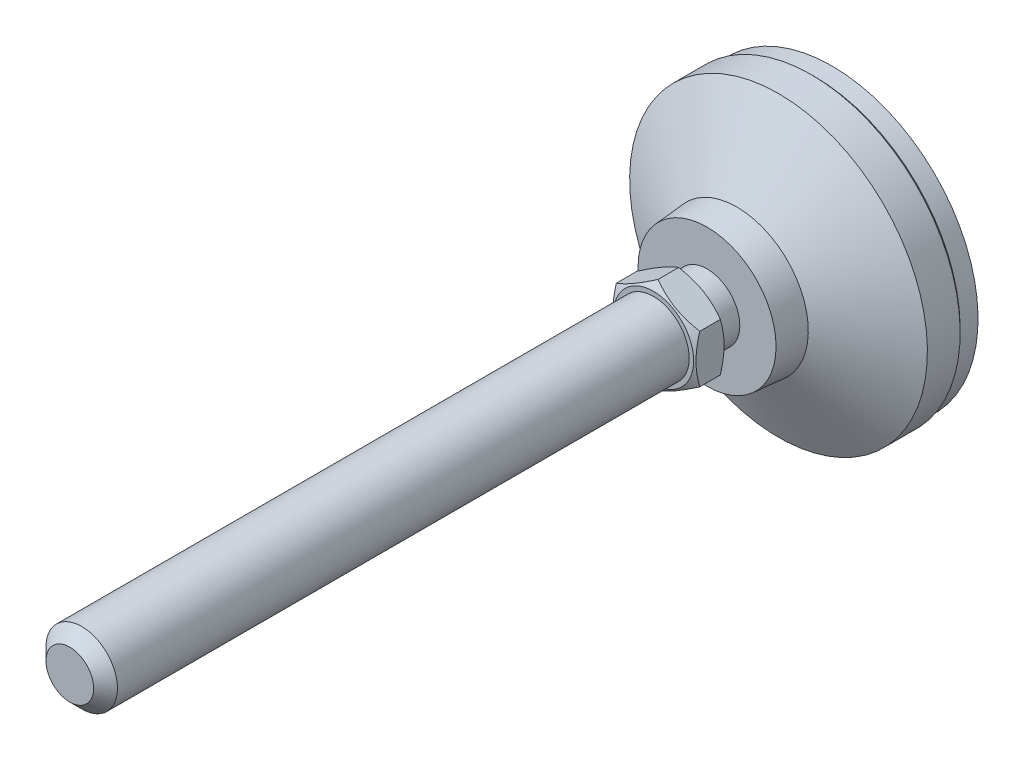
ISO-10303-21;
HEADER;
FILE_DESCRIPTION(('STEP AP214'),'2;1');
FILE_NAME('part.step','',(''),(''),'','','');
FILE_SCHEMA(('AUTOMOTIVE_DESIGN { 1 0 10303 214 1 1 1 1 }'));
ENDSEC;
DATA;
#1=APPLICATION_CONTEXT('core data for automotive mechanical design processes');
#2=APPLICATION_PROTOCOL_DEFINITION('international standard','automotive_design',2000,#1);
#3=PRODUCT_CONTEXT('',#1,'mechanical');
#4=PRODUCT('Part','Part','',(#3));
#5=PRODUCT_RELATED_PRODUCT_CATEGORY('part','',(#4));
#6=PRODUCT_DEFINITION_FORMATION('','',#4);
#7=PRODUCT_DEFINITION_CONTEXT('part definition',#1,'design');
#8=PRODUCT_DEFINITION('design','',#6,#7);
#9=PRODUCT_DEFINITION_SHAPE('','',#8);
#10=(LENGTH_UNIT() NAMED_UNIT(*) SI_UNIT(.MILLI.,.METRE.));
#11=(NAMED_UNIT(*) PLANE_ANGLE_UNIT() SI_UNIT($,.RADIAN.));
#12=(NAMED_UNIT(*) SI_UNIT($,.STERADIAN.) SOLID_ANGLE_UNIT());
#13=UNCERTAINTY_MEASURE_WITH_UNIT(LENGTH_MEASURE(1.E-05),#10,'distance_accuracy_value','');
#14=(GEOMETRIC_REPRESENTATION_CONTEXT(3) GLOBAL_UNCERTAINTY_ASSIGNED_CONTEXT((#13)) GLOBAL_UNIT_ASSIGNED_CONTEXT((#10,
#11,#12)) REPRESENTATION_CONTEXT('',''));
#15=CARTESIAN_POINT('',(0.,0.,0.));
#16=DIRECTION('',(0.,0.,1.));
#17=DIRECTION('',(1.,0.,0.));
#18=AXIS2_PLACEMENT_3D('',#15,#16,#17);
#19=CARTESIAN_POINT('',(0.,0.,1.99999999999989));
#20=DIRECTION('',(0.,0.,-1.));
#21=DIRECTION('',(0.,1.,0.));
#22=AXIS2_PLACEMENT_3D('',#19,#20,#21);
#23=CYLINDRICAL_SURFACE('',#22,5.5);
#24=CARTESIAN_POINT('',(0.,0.,24.9999999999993));
#25=DIRECTION('',(0.,0.,-1.));
#26=DIRECTION('',(0.,1.,0.));
#27=AXIS2_PLACEMENT_3D('',#24,#25,#26);
#28=CIRCLE('',#27,5.5);
#29=CARTESIAN_POINT('',(0.,5.5,24.9999999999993));
#30=VERTEX_POINT('',#29);
#31=EDGE_CURVE('E100',#30,#30,#28,.T.);
#32=ORIENTED_EDGE('',*,*,#31,.T.);
#33=EDGE_LOOP('',(#32));
#34=FACE_BOUND('',#33,.T.);
#35=CARTESIAN_POINT('',(0.,0.,21.));
#36=DIRECTION('',(0.,0.,-1.));
#37=DIRECTION('',(0.,1.,0.));
#38=AXIS2_PLACEMENT_3D('',#35,#36,#37);
#39=CIRCLE('',#38,5.5);
#40=CARTESIAN_POINT('',(0.,5.5,21.));
#41=VERTEX_POINT('',#40);
#42=EDGE_CURVE('E93',#41,#41,#39,.T.);
#43=ORIENTED_EDGE('',*,*,#42,.F.);
#44=EDGE_LOOP('',(#43));
#45=FACE_BOUND('',#44,.T.);
#46=ADVANCED_FACE('F14',(#34,#45),#23,.T.);
#47=CARTESIAN_POINT('',(-5.5,0.,24.9999999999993));
#48=DIRECTION('',(0.,0.,1.));
#49=DIRECTION('',(0.,-1.,0.));
#50=AXIS2_PLACEMENT_3D('',#47,#48,#49);
#51=PLANE('',#50);
#52=CARTESIAN_POINT('',(0.,0.,24.9999999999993));
#53=DIRECTION('',(0.,0.,1.));
#54=DIRECTION('',(0.,-1.,0.));
#55=AXIS2_PLACEMENT_3D('',#52,#53,#54);
#56=CIRCLE('',#55,6.75);
#57=CARTESIAN_POINT('',(0.,-6.75,24.9999999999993));
#58=VERTEX_POINT('',#57);
#59=EDGE_CURVE('E443',#58,#58,#56,.T.);
#60=ORIENTED_EDGE('',*,*,#59,.F.);
#61=EDGE_LOOP('',(#60));
#62=FACE_BOUND('',#61,.T.);
#63=ORIENTED_EDGE('',*,*,#31,.F.);
#64=EDGE_LOOP('',(#63));
#65=FACE_BOUND('',#64,.T.);
#66=ADVANCED_FACE('F137',(#62,#65),#51,.F.);
#67=CARTESIAN_POINT('',(0.,-5.5,21.));
#68=DIRECTION('',(0.,0.,1.));
#69=DIRECTION('',(0.,-1.,0.));
#70=AXIS2_PLACEMENT_3D('',#67,#68,#69);
#71=PLANE('',#70);
#72=ORIENTED_EDGE('',*,*,#42,.T.);
#73=EDGE_LOOP('',(#72));
#74=FACE_BOUND('',#73,.T.);
#75=CARTESIAN_POINT('',(0.,0.,21.));
#76=DIRECTION('',(0.,0.,1.));
#77=DIRECTION('',(0.,-1.,0.));
#78=AXIS2_PLACEMENT_3D('',#75,#76,#77);
#79=CIRCLE('',#78,11.5833333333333);
#80=CARTESIAN_POINT('',(0.,-11.5833333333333,21.));
#81=VERTEX_POINT('',#80);
#82=EDGE_CURVE('E88',#81,#81,#79,.T.);
#83=ORIENTED_EDGE('',*,*,#82,.T.);
#84=EDGE_LOOP('',(#83));
#85=FACE_BOUND('',#84,.T.);
#86=ADVANCED_FACE('F144',(#74,#85),#71,.T.);
#87=CARTESIAN_POINT('',(0.,0.,1.99999999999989));
#88=DIRECTION('',(0.,0.,-1.));
#89=DIRECTION('',(0.,1.,0.));
#90=AXIS2_PLACEMENT_3D('',#87,#88,#89);
#91=CYLINDRICAL_SURFACE('',#90,25.);
#92=CARTESIAN_POINT('',(0.,0.,3.5));
#93=DIRECTION('',(0.,0.,-1.));
#94=DIRECTION('',(0.,1.,0.));
#95=AXIS2_PLACEMENT_3D('',#92,#93,#94);
#96=CIRCLE('',#95,25.);
#97=CARTESIAN_POINT('',(0.,25.,3.5));
#98=VERTEX_POINT('',#97);
#99=EDGE_CURVE('E28',#98,#98,#96,.F.);
#100=ORIENTED_EDGE('',*,*,#99,.T.);
#101=EDGE_LOOP('',(#100));
#102=FACE_BOUND('',#101,.T.);
#103=CARTESIAN_POINT('',(0.,0.,9.));
#104=DIRECTION('',(0.,0.,-1.));
#105=DIRECTION('',(0.,1.,0.));
#106=AXIS2_PLACEMENT_3D('',#103,#104,#105);
#107=CIRCLE('',#106,25.);
#108=CARTESIAN_POINT('',(0.,25.,9.));
#109=VERTEX_POINT('',#108);
#110=EDGE_CURVE('E106',#109,#109,#107,.T.);
#111=ORIENTED_EDGE('',*,*,#110,.T.);
#112=EDGE_LOOP('',(#111));
#113=FACE_BOUND('',#112,.T.);
#114=ADVANCED_FACE('F114',(#102,#113),#91,.T.);
#115=CARTESIAN_POINT('',(0.,0.,16.));
#116=DIRECTION('',(0.,0.,-1.));
#117=DIRECTION('',(0.,1.,0.));
#118=AXIS2_PLACEMENT_3D('',#115,#116,#117);
#119=CONICAL_SURFACE('',#118,11.9999999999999,1.07685495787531);
#120=ORIENTED_EDGE('',*,*,#110,.F.);
#121=EDGE_LOOP('',(#120));
#122=FACE_BOUND('',#121,.T.);
#123=CARTESIAN_POINT('',(0.,0.,16.));
#124=DIRECTION('',(0.,0.,-1.));
#125=DIRECTION('',(0.,1.,0.));
#126=AXIS2_PLACEMENT_3D('',#123,#124,#125);
#127=CIRCLE('',#126,11.9999999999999);
#128=CARTESIAN_POINT('',(0.,11.9999999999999,16.));
#129=VERTEX_POINT('',#128);
#130=EDGE_CURVE('E103',#129,#129,#127,.T.);
#131=ORIENTED_EDGE('',*,*,#130,.T.);
#132=EDGE_LOOP('',(#131));
#133=FACE_BOUND('',#132,.T.);
#134=ADVANCED_FACE('F152',(#122,#133),#119,.T.);
#135=CARTESIAN_POINT('',(0.,0.,22.));
#136=DIRECTION('',(0.,0.,-1.));
#137=DIRECTION('',(0.,1.,0.));
#138=AXIS2_PLACEMENT_3D('',#135,#136,#137);
#139=CONICAL_SURFACE('',#138,11.5,0.0831412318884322);
#140=ORIENTED_EDGE('',*,*,#130,.F.);
#141=EDGE_LOOP('',(#140));
#142=FACE_BOUND('',#141,.T.);
#143=ORIENTED_EDGE('',*,*,#82,.F.);
#144=EDGE_LOOP('',(#143));
#145=FACE_BOUND('',#144,.T.);
#146=ADVANCED_FACE('F120',(#142,#145),#139,.T.);
#147=CARTESIAN_POINT('',(0.,0.,3.));
#148=DIRECTION('',(0.,0.,1.));
#149=DIRECTION('',(0.,-1.,0.));
#150=AXIS2_PLACEMENT_3D('',#147,#148,#149);
#151=CONICAL_SURFACE('',#150,24.5,0.785398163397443);
#152=ORIENTED_EDGE('',*,*,#99,.F.);
#153=EDGE_LOOP('',(#152));
#154=FACE_BOUND('',#153,.T.);
#155=CARTESIAN_POINT('',(0.,0.,3.));
#156=DIRECTION('',(0.,0.,-1.));
#157=DIRECTION('',(0.,1.,0.));
#158=AXIS2_PLACEMENT_3D('',#155,#156,#157);
#159=CIRCLE('',#158,24.5);
#160=CARTESIAN_POINT('',(0.,24.5,3.));
#161=VERTEX_POINT('',#160);
#162=EDGE_CURVE('E108',#161,#161,#159,.T.);
#163=ORIENTED_EDGE('',*,*,#162,.F.);
#164=EDGE_LOOP('',(#163));
#165=FACE_BOUND('',#164,.T.);
#166=ADVANCED_FACE('F16',(#154,#165),#151,.T.);
#167=CARTESIAN_POINT('',(0.,0.,0.));
#168=DIRECTION('',(0.,0.,1.));
#169=DIRECTION('',(0.,-1.,0.));
#170=AXIS2_PLACEMENT_3D('',#167,#168,#169);
#171=CYLINDRICAL_SURFACE('',#170,24.5);
#172=CARTESIAN_POINT('',(0.,0.,0.));
#173=DIRECTION('',(0.,0.,-1.));
#174=DIRECTION('',(0.,1.,0.));
#175=AXIS2_PLACEMENT_3D('',#172,#173,#174);
#176=CIRCLE('',#175,24.5);
#177=CARTESIAN_POINT('',(0.,24.5,0.));
#178=VERTEX_POINT('',#177);
#179=EDGE_CURVE('E260',#178,#178,#176,.T.);
#180=ORIENTED_EDGE('',*,*,#179,.F.);
#181=EDGE_LOOP('',(#180));
#182=FACE_BOUND('',#181,.T.);
#183=ORIENTED_EDGE('',*,*,#162,.T.);
#184=EDGE_LOOP('',(#183));
#185=FACE_BOUND('',#184,.T.);
#186=ADVANCED_FACE('F119',(#182,#185),#171,.T.);
#187=CARTESIAN_POINT('',(0.,0.,0.));
#188=DIRECTION('',(0.,0.,-1.));
#189=DIRECTION('',(0.,1.,0.));
#190=AXIS2_PLACEMENT_3D('',#187,#188,#189);
#191=PLANE('',#190);
#192=ORIENTED_EDGE('',*,*,#179,.T.);
#193=EDGE_LOOP('',(#192));
#194=FACE_BOUND('',#193,.T.);
#195=ADVANCED_FACE('F124',(#194),#191,.T.);
#196=CARTESIAN_POINT('',(0.,0.,24.9999999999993));
#197=DIRECTION('',(0.,0.,1.));
#198=DIRECTION('',(0.,-1.,0.));
#199=AXIS2_PLACEMENT_3D('',#196,#197,#198);
#200=CONICAL_SURFACE('',#199,6.75,1.0471975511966);
#201=CARTESIAN_POINT('',(0.000200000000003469,-8.0830192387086,25.7696190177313));
#202=CARTESIAN_POINT('',(-0.15366790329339,-7.99418356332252,25.7183374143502));
#203=CARTESIAN_POINT('',(-0.308109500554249,-7.90501666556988,25.6693831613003));
#204=CARTESIAN_POINT('',(-0.618246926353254,-7.72595873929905,25.5767703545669));
#205=CARTESIAN_POINT('',(-0.773943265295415,-7.63606741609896,25.5331140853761));
#206=CARTESIAN_POINT('',(-1.24352516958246,-7.36495417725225,25.4109491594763));
#207=CARTESIAN_POINT('',(-1.5592643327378,-7.18266208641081,25.3414631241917));
#208=CARTESIAN_POINT('',(-2.03176224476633,-6.90986528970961,25.2599825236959));
#209=CARTESIAN_POINT('',(-2.18710922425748,-6.82017566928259,25.2367710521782));
#210=CARTESIAN_POINT('',(-2.49850511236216,-6.64039116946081,25.1978487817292));
#211=CARTESIAN_POINT('',(-2.65455395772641,-6.55029632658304,25.1821373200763));
#212=CARTESIAN_POINT('',(-2.96692267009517,-6.36995016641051,25.1586154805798));
#213=CARTESIAN_POINT('',(-3.12324202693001,-6.27969914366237,25.1507961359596));
#214=CARTESIAN_POINT('',(-3.43601650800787,-6.09911871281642,25.1432178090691));
#215=CARTESIAN_POINT('',(-3.59247162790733,-6.00878930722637,25.1434585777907));
#216=CARTESIAN_POINT('',(-4.02110687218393,-5.76131663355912,25.1551972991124));
#217=CARTESIAN_POINT('',(-4.2931466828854,-5.60425437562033,25.1749033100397));
#218=CARTESIAN_POINT('',(-4.83541944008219,-5.29117305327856,25.2373910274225));
#219=CARTESIAN_POINT('',(-5.10565047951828,-5.13515508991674,25.2801940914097));
#220=CARTESIAN_POINT('',(-5.64901454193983,-4.82144370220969,25.3871892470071));
#221=CARTESIAN_POINT('',(-5.92207900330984,-4.6637898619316,25.4518346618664));
#222=CARTESIAN_POINT('',(-6.46413578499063,-4.35083323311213,25.5985536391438));
#223=CARTESIAN_POINT('',(-6.73313504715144,-4.19552643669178,25.6805927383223));
#224=CARTESIAN_POINT('',(-7.0002,-4.04133641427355,25.7696190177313));
#225=B_SPLINE_CURVE_WITH_KNOTS('',3,(#201,#202,#203,#204,#205,#206,#207,#208,#209,#210,#211,
#212,#213,#214,#215,#216,#217,#218,#219,#220,#221,#222,#223,#224),.UNSPECIFIED.,.F.,.F.,(4,2,2,
2,2,2,2,2,2,2,2,4),(0.,0.554727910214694,1.10969417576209,2.2219327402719,2.76443041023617,
3.30688013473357,3.8487128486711,4.39052882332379,5.33376515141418,6.27787517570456,
7.24292418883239,8.20607866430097),.UNSPECIFIED.);
#226=CARTESIAN_POINT('',(0.,-8.08290376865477,25.7695523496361));
#227=VERTEX_POINT('',#226);
#228=CARTESIAN_POINT('',(-7.,-4.04145188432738,25.769552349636));
#229=VERTEX_POINT('',#228);
#230=EDGE_CURVE('E73',#227,#229,#225,.T.);
#231=ORIENTED_EDGE('',*,*,#230,.T.);
#232=CARTESIAN_POINT('',(-7.,10.8191232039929,28.5427205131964));
#233=CARTESIAN_POINT('',(-7.,10.5136920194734,28.3947070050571));
#234=CARTESIAN_POINT('',(-7.,10.207555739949,28.2481233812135));
#235=CARTESIAN_POINT('',(-7.,9.59349786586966,27.9586208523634));
#236=CARTESIAN_POINT('',(-7.,9.28557599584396,27.8157025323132));
#237=CARTESIAN_POINT('',(-7.,8.66596763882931,27.5336086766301));
#238=CARTESIAN_POINT('',(-7.,8.35426975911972,27.3944580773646));
#239=CARTESIAN_POINT('',(-7.,7.72838200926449,27.1219007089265));
#240=CARTESIAN_POINT('',(-7.,7.41419225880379,26.9884936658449));
#241=CARTESIAN_POINT('',(-7.,6.77282425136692,26.7248315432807));
#242=CARTESIAN_POINT('',(-7.,6.44554956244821,26.5948097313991));
#243=CARTESIAN_POINT('',(-7.,5.78715855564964,26.3446958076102));
#244=CARTESIAN_POINT('',(-7.,5.45604180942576,26.22460481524));
#245=CARTESIAN_POINT('',(-7.,4.79006759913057,25.9975324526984));
#246=CARTESIAN_POINT('',(-7.,4.45521939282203,25.8905242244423));
#247=CARTESIAN_POINT('',(-7.,3.78073219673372,25.693073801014));
#248=CARTESIAN_POINT('',(-7.,3.44109476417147,25.6026263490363));
#249=CARTESIAN_POINT('',(-7.,2.7586563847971,25.4431470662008));
#250=CARTESIAN_POINT('',(-7.,2.41588298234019,25.3740005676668));
#251=CARTESIAN_POINT('',(-7.,1.89863106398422,25.289268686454));
#252=CARTESIAN_POINT('',(-7.,1.72568547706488,25.2641882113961));
#253=CARTESIAN_POINT('',(-7.,1.37894721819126,25.2208493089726));
#254=CARTESIAN_POINT('',(-7.,1.20515462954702,25.2025902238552));
#255=CARTESIAN_POINT('',(-7.,0.859209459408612,25.1734849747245));
#256=CARTESIAN_POINT('',(-7.,0.6870647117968,25.1625460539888));
#257=CARTESIAN_POINT('',(-7.,0.342467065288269,25.1479551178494));
#258=CARTESIAN_POINT('',(-7.,0.170014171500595,25.1443029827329));
#259=CARTESIAN_POINT('',(-7.,-0.174891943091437,25.1443726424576));
#260=CARTESIAN_POINT('',(-7.,-0.347345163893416,25.14809447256));
#261=CARTESIAN_POINT('',(-7.,-0.691942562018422,25.1628217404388));
#262=CARTESIAN_POINT('',(-7.,-0.864086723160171,25.1738275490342));
#263=CARTESIAN_POINT('',(-7.,-1.27892013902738,25.2088944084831));
#264=CARTESIAN_POINT('',(-7.,-1.52131815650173,25.2364735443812));
#265=CARTESIAN_POINT('',(-7.,-2.00427950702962,25.3045610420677));
#266=CARTESIAN_POINT('',(-7.,-2.24484258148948,25.3450711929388));
#267=CARTESIAN_POINT('',(-7.,-2.96352430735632,25.4838470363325));
#268=CARTESIAN_POINT('',(-7.,-3.43835999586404,25.5993317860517));
#269=CARTESIAN_POINT('',(-7.,-4.14831932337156,25.7991454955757));
#270=CARTESIAN_POINT('',(-7.,-4.38713668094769,25.8711012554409));
#271=CARTESIAN_POINT('',(-7.,-4.86245105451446,26.0223749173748));
#272=CARTESIAN_POINT('',(-7.,-5.09894805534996,26.1016928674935));
#273=CARTESIAN_POINT('',(-7.,-5.56969828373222,26.2664275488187));
#274=CARTESIAN_POINT('',(-7.,-5.80395224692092,26.3518421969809));
#275=CARTESIAN_POINT('',(-7.,-6.27052681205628,26.5277764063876));
#276=CARTESIAN_POINT('',(-7.,-6.50284743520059,26.6182959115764));
#277=CARTESIAN_POINT('',(-7.,-7.04518800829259,26.8353782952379));
#278=CARTESIAN_POINT('',(-7.,-7.35452147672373,26.9636529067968));
#279=CARTESIAN_POINT('',(-7.,-7.97060958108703,27.2262696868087));
#280=CARTESIAN_POINT('',(-7.,-8.27736406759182,27.3606122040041));
#281=CARTESIAN_POINT('',(-7.,-8.88876080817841,27.6341628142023));
#282=CARTESIAN_POINT('',(-7.,-9.19340264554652,27.7733718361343));
#283=CARTESIAN_POINT('',(-7.,-9.80087448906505,28.0556953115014));
#284=CARTESIAN_POINT('',(-7.,-10.1037044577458,28.1988098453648));
#285=CARTESIAN_POINT('',(-7.,-10.7081501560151,28.4883667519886));
#286=CARTESIAN_POINT('',(-7.,-11.0097643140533,28.6348123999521));
#287=CARTESIAN_POINT('',(-7.,-11.6117043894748,28.9303301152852));
#288=CARTESIAN_POINT('',(-7.,-11.9120302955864,29.0794022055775));
#289=CARTESIAN_POINT('',(-7.,-12.8113035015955,29.5298300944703));
#290=CARTESIAN_POINT('',(-7.,-13.4086233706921,29.8344347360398));
#291=CARTESIAN_POINT('',(-7.,-14.5511090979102,30.4244628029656));
#292=CARTESIAN_POINT('',(-7.,-15.0965250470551,30.709404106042));
#293=CARTESIAN_POINT('',(-7.,-16.1853257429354,31.2831826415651));
#294=CARTESIAN_POINT('',(-7.,-16.7287104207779,31.572020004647));
#295=CARTESIAN_POINT('',(-7.,-17.8125832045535,32.1519681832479));
#296=CARTESIAN_POINT('',(-7.,-18.3530751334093,32.4430718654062));
#297=CARTESIAN_POINT('',(-7.,-19.4327568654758,33.0276165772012));
#298=CARTESIAN_POINT('',(-7.,-19.9719467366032,33.3210574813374));
#299=CARTESIAN_POINT('',(-7.,-20.5106556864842,33.6153727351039));
#300=B_SPLINE_CURVE_WITH_KNOTS('',3,(#232,#233,#234,#235,#236,#237,#238,#239,#240,#241,#242,
#243,#244,#245,#246,#247,#248,#249,#250,#251,#252,#253,#254,#255,#256,#257,#258,#259,#260,#261,
#262,#263,#264,#265,#266,#267,#268,#269,#270,#271,#272,#273,#274,#275,#276,#277,#278,#279,#280,
#281,#282,#283,#284,#285,#286,#287,#288,#289,#290,#291,#292,#293,#294,#295,#296,#297,#298,#299),
.UNSPECIFIED.,.F.,.F.,(4,2,2,2,2,2,2,2,2,2,2,2,2,2,2,2,2,2,2,2,2,2,2,2,2,2,2,2,2,2,2,2,2,4),(0.,
1.01822961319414,2.03662072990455,3.06061831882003,4.08456701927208,5.14091231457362,
6.19737653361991,7.25163412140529,8.30555647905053,9.35370198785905,9.87785271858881,
10.4019528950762,10.9192794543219,11.4365975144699,11.9539180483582,12.4712649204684,
13.2027365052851,13.9343093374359,15.3982814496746,16.1464866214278,16.8946966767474,
17.6426523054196,18.3905997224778,19.3951394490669,20.3997369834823,21.4045273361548,
22.4093383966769,23.4151842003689,24.4210387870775,26.4324911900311,28.2785596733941,
30.124690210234,31.9663832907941,33.8079781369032),.UNSPECIFIED.);
#301=CARTESIAN_POINT('',(-7.,4.04145188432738,25.769552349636));
#302=VERTEX_POINT('',#301);
#303=EDGE_CURVE('E81',#229,#302,#300,.F.);
#304=ORIENTED_EDGE('',*,*,#303,.T.);
#305=CARTESIAN_POINT('',(-7.0002,4.04133641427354,25.7696190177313));
#306=CARTESIAN_POINT('',(-6.84633209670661,4.13017208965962,25.7183374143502));
#307=CARTESIAN_POINT('',(-6.69189049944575,4.21933898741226,25.6693831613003));
#308=CARTESIAN_POINT('',(-6.38175307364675,4.39839691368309,25.5767703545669));
#309=CARTESIAN_POINT('',(-6.22605673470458,4.48828823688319,25.5331140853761));
#310=CARTESIAN_POINT('',(-5.75647483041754,4.75940147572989,25.4109491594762));
#311=CARTESIAN_POINT('',(-5.4407356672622,4.94169356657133,25.3414631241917));
#312=CARTESIAN_POINT('',(-4.96823775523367,5.21449036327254,25.2599825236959));
#313=CARTESIAN_POINT('',(-4.81289077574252,5.30417998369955,25.2367710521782));
#314=CARTESIAN_POINT('',(-4.50149488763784,5.48396448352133,25.1978487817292));
#315=CARTESIAN_POINT('',(-4.34544604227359,5.57405932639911,25.1821373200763));
#316=CARTESIAN_POINT('',(-4.03307732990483,5.75440548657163,25.1586154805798));
#317=CARTESIAN_POINT('',(-3.87675797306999,5.84465650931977,25.1507961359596));
#318=CARTESIAN_POINT('',(-3.56398349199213,6.02523694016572,25.1432178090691));
#319=CARTESIAN_POINT('',(-3.40752837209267,6.11556634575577,25.1434585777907));
#320=CARTESIAN_POINT('',(-2.97889312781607,6.36303901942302,25.1551972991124));
#321=CARTESIAN_POINT('',(-2.7068533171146,6.52010127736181,25.1749033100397));
#322=CARTESIAN_POINT('',(-2.16458055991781,6.83318259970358,25.2373910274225));
#323=CARTESIAN_POINT('',(-1.89434952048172,6.9892005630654,25.2801940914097));
#324=CARTESIAN_POINT('',(-1.35098545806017,7.30291195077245,25.3871892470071));
#325=CARTESIAN_POINT('',(-1.07792099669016,7.46056579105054,25.4518346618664));
#326=CARTESIAN_POINT('',(-0.535864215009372,7.77352241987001,25.5985536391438));
#327=CARTESIAN_POINT('',(-0.266864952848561,7.92882921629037,25.6805927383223));
#328=CARTESIAN_POINT('',(0.000199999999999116,8.0830192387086,25.7696190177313));
#329=B_SPLINE_CURVE_WITH_KNOTS('',3,(#305,#306,#307,#308,#309,#310,#311,#312,#313,#314,#315,
#316,#317,#318,#319,#320,#321,#322,#323,#324,#325,#326,#327,#328),.UNSPECIFIED.,.F.,.F.,(4,2,2,
2,2,2,2,2,2,2,2,4),(0.,0.554727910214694,1.10969417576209,2.2219327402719,2.76443041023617,
3.30688013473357,3.84871284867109,4.39052882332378,5.33376515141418,6.27787517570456,
7.2429241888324,8.20607866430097),.UNSPECIFIED.);
#330=CARTESIAN_POINT('',(0.,8.08290376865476,25.769552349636));
#331=VERTEX_POINT('',#330);
#332=EDGE_CURVE('E195',#302,#331,#329,.T.);
#333=ORIENTED_EDGE('',*,*,#332,.T.);
#334=CARTESIAN_POINT('',(-0.000200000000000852,8.0830192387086,25.7696190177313));
#335=CARTESIAN_POINT('',(0.153667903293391,7.99418356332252,25.7183374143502));
#336=CARTESIAN_POINT('',(0.308109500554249,7.90501666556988,25.6693831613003));
#337=CARTESIAN_POINT('',(0.618246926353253,7.72595873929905,25.5767703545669));
#338=CARTESIAN_POINT('',(0.773943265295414,7.63606741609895,25.5331140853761));
#339=CARTESIAN_POINT('',(1.24352516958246,7.36495417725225,25.4109491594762));
#340=CARTESIAN_POINT('',(1.5592643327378,7.18266208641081,25.3414631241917));
#341=CARTESIAN_POINT('',(2.03176224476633,6.9098652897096,25.2599825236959));
#342=CARTESIAN_POINT('',(2.18710922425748,6.82017566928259,25.2367710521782));
#343=CARTESIAN_POINT('',(2.49850511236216,6.64039116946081,25.1978487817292));
#344=CARTESIAN_POINT('',(2.65455395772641,6.55029632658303,25.1821373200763));
#345=CARTESIAN_POINT('',(2.96692267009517,6.36995016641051,25.1586154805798));
#346=CARTESIAN_POINT('',(3.12324202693,6.27969914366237,25.1507961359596));
#347=CARTESIAN_POINT('',(3.43601650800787,6.09911871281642,25.1432178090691));
#348=CARTESIAN_POINT('',(3.59247162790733,6.00878930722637,25.1434585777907));
#349=CARTESIAN_POINT('',(4.02110687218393,5.76131663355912,25.1551972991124));
#350=CARTESIAN_POINT('',(4.2931466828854,5.60425437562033,25.1749033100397));
#351=CARTESIAN_POINT('',(4.83541944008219,5.29117305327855,25.2373910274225));
#352=CARTESIAN_POINT('',(5.10565047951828,5.13515508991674,25.2801940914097));
#353=CARTESIAN_POINT('',(5.64901454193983,4.82144370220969,25.3871892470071));
#354=CARTESIAN_POINT('',(5.92207900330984,4.66378986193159,25.4518346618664));
#355=CARTESIAN_POINT('',(6.46413578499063,4.35083323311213,25.5985536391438));
#356=CARTESIAN_POINT('',(6.73313504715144,4.19552643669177,25.6805927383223));
#357=CARTESIAN_POINT('',(7.0002,4.04133641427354,25.7696190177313));
#358=B_SPLINE_CURVE_WITH_KNOTS('',3,(#334,#335,#336,#337,#338,#339,#340,#341,#342,#343,#344,
#345,#346,#347,#348,#349,#350,#351,#352,#353,#354,#355,#356,#357),.UNSPECIFIED.,.F.,.F.,(4,2,2,
2,2,2,2,2,2,2,2,4),(0.,0.554727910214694,1.10969417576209,2.2219327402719,2.76443041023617,
3.30688013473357,3.8487128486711,4.39052882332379,5.33376515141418,6.27787517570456,
7.2429241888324,8.20607866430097),.UNSPECIFIED.);
#359=CARTESIAN_POINT('',(7.,4.04145188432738,25.769552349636));
#360=VERTEX_POINT('',#359);
#361=EDGE_CURVE('E223',#331,#360,#358,.T.);
#362=ORIENTED_EDGE('',*,*,#361,.T.);
#363=CARTESIAN_POINT('',(7.,10.8191232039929,28.5427205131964));
#364=CARTESIAN_POINT('',(7.,10.5136920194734,28.3947070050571));
#365=CARTESIAN_POINT('',(7.,10.207555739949,28.2481233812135));
#366=CARTESIAN_POINT('',(7.,9.59349786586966,27.9586208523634));
#367=CARTESIAN_POINT('',(7.,9.28557599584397,27.8157025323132));
#368=CARTESIAN_POINT('',(7.,8.66596763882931,27.5336086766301));
#369=CARTESIAN_POINT('',(7.,8.35426975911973,27.3944580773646));
#370=CARTESIAN_POINT('',(7.,7.72838200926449,27.1219007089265));
#371=CARTESIAN_POINT('',(7.,7.41419225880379,26.9884936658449));
#372=CARTESIAN_POINT('',(7.,6.77282425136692,26.7248315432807));
#373=CARTESIAN_POINT('',(7.,6.44554956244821,26.5948097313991));
#374=CARTESIAN_POINT('',(7.,5.78715855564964,26.3446958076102));
#375=CARTESIAN_POINT('',(7.,5.45604180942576,26.22460481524));
#376=CARTESIAN_POINT('',(7.,4.79006759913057,25.9975324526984));
#377=CARTESIAN_POINT('',(7.,4.45521939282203,25.8905242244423));
#378=CARTESIAN_POINT('',(7.,3.78073219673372,25.693073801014));
#379=CARTESIAN_POINT('',(7.,3.44109476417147,25.6026263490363));
#380=CARTESIAN_POINT('',(7.,2.7586563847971,25.4431470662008));
#381=CARTESIAN_POINT('',(7.,2.41588298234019,25.3740005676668));
#382=CARTESIAN_POINT('',(7.,1.89863106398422,25.289268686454));
#383=CARTESIAN_POINT('',(7.,1.72568547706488,25.2641882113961));
#384=CARTESIAN_POINT('',(7.,1.37894721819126,25.2208493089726));
#385=CARTESIAN_POINT('',(7.,1.20515462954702,25.2025902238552));
#386=CARTESIAN_POINT('',(7.,0.859209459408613,25.1734849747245));
#387=CARTESIAN_POINT('',(7.,0.687064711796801,25.1625460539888));
#388=CARTESIAN_POINT('',(7.,0.34246706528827,25.1479551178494));
#389=CARTESIAN_POINT('',(7.,0.170014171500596,25.1443029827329));
#390=CARTESIAN_POINT('',(7.,-0.174891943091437,25.1443726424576));
#391=CARTESIAN_POINT('',(7.,-0.347345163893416,25.14809447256));
#392=CARTESIAN_POINT('',(7.,-0.691942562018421,25.1628217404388));
#393=CARTESIAN_POINT('',(7.,-0.864086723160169,25.1738275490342));
#394=CARTESIAN_POINT('',(7.,-1.27892013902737,25.2088944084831));
#395=CARTESIAN_POINT('',(7.,-1.52131815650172,25.2364735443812));
#396=CARTESIAN_POINT('',(7.,-2.00427950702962,25.3045610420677));
#397=CARTESIAN_POINT('',(7.,-2.24484258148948,25.3450711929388));
#398=CARTESIAN_POINT('',(7.,-2.96352430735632,25.4838470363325));
#399=CARTESIAN_POINT('',(7.,-3.43835999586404,25.5993317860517));
#400=CARTESIAN_POINT('',(7.,-4.14831932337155,25.7991454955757));
#401=CARTESIAN_POINT('',(7.,-4.38713668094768,25.8711012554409));
#402=CARTESIAN_POINT('',(7.,-4.86245105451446,26.0223749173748));
#403=CARTESIAN_POINT('',(7.,-5.09894805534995,26.1016928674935));
#404=CARTESIAN_POINT('',(7.,-5.56969828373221,26.2664275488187));
#405=CARTESIAN_POINT('',(7.,-5.80395224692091,26.3518421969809));
#406=CARTESIAN_POINT('',(7.,-6.27052681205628,26.5277764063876));
#407=CARTESIAN_POINT('',(7.,-6.50284743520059,26.6182959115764));
#408=CARTESIAN_POINT('',(7.,-7.04518800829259,26.8353782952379));
#409=CARTESIAN_POINT('',(7.,-7.35452147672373,26.9636529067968));
#410=CARTESIAN_POINT('',(7.,-7.97060958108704,27.2262696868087));
#411=CARTESIAN_POINT('',(7.,-8.27736406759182,27.3606122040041));
#412=CARTESIAN_POINT('',(7.,-8.88876080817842,27.6341628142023));
#413=CARTESIAN_POINT('',(7.,-9.19340264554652,27.7733718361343));
#414=CARTESIAN_POINT('',(7.,-9.80087448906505,28.0556953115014));
#415=CARTESIAN_POINT('',(7.,-10.1037044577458,28.1988098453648));
#416=CARTESIAN_POINT('',(7.,-10.7081501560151,28.4883667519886));
#417=CARTESIAN_POINT('',(7.,-11.0097643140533,28.6348123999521));
#418=CARTESIAN_POINT('',(7.,-11.6117043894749,28.9303301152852));
#419=CARTESIAN_POINT('',(7.,-11.9120302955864,29.0794022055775));
#420=CARTESIAN_POINT('',(7.,-12.8113035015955,29.5298300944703));
#421=CARTESIAN_POINT('',(7.,-13.4086233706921,29.8344347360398));
#422=CARTESIAN_POINT('',(7.,-14.5511090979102,30.4244628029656));
#423=CARTESIAN_POINT('',(7.,-15.0965250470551,30.709404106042));
#424=CARTESIAN_POINT('',(7.,-16.1853257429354,31.2831826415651));
#425=CARTESIAN_POINT('',(7.,-16.7287104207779,31.572020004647));
#426=CARTESIAN_POINT('',(7.,-17.8125832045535,32.1519681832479));
#427=CARTESIAN_POINT('',(7.,-18.3530751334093,32.4430718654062));
#428=CARTESIAN_POINT('',(7.,-19.4327568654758,33.0276165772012));
#429=CARTESIAN_POINT('',(7.,-19.9719467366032,33.3210574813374));
#430=CARTESIAN_POINT('',(7.,-20.5106556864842,33.6153727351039));
#431=B_SPLINE_CURVE_WITH_KNOTS('',3,(#363,#364,#365,#366,#367,#368,#369,#370,#371,#372,#373,
#374,#375,#376,#377,#378,#379,#380,#381,#382,#383,#384,#385,#386,#387,#388,#389,#390,#391,#392,
#393,#394,#395,#396,#397,#398,#399,#400,#401,#402,#403,#404,#405,#406,#407,#408,#409,#410,#411,
#412,#413,#414,#415,#416,#417,#418,#419,#420,#421,#422,#423,#424,#425,#426,#427,#428,#429,#430),
.UNSPECIFIED.,.F.,.F.,(4,2,2,2,2,2,2,2,2,2,2,2,2,2,2,2,2,2,2,2,2,2,2,2,2,2,2,2,2,2,2,2,2,4),(0.,
1.01822961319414,2.03662072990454,3.06061831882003,4.08456701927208,5.14091231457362,
6.19737653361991,7.25163412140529,8.30555647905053,9.35370198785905,9.87785271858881,
10.4019528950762,10.9192794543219,11.4365975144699,11.9539180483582,12.4712649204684,
13.2027365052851,13.9343093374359,15.3982814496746,16.1464866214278,16.8946966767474,
17.6426523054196,18.3905997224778,19.3951394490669,20.3997369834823,21.4045273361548,
22.4093383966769,23.415184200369,24.4210387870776,26.4324911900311,28.2785596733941,
30.124690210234,31.9663832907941,33.8079781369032),.UNSPECIFIED.);
#432=CARTESIAN_POINT('',(7.,-4.04145188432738,25.769552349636));
#433=VERTEX_POINT('',#432);
#434=EDGE_CURVE('E34',#360,#433,#431,.T.);
#435=ORIENTED_EDGE('',*,*,#434,.T.);
#436=CARTESIAN_POINT('',(7.0002,-4.04133641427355,25.7696190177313));
#437=CARTESIAN_POINT('',(6.84633209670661,-4.13017208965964,25.7183374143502));
#438=CARTESIAN_POINT('',(6.69189049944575,-4.21933898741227,25.6693831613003));
#439=CARTESIAN_POINT('',(6.38175307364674,-4.3983969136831,25.5767703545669));
#440=CARTESIAN_POINT('',(6.22605673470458,-4.4882882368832,25.5331140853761));
#441=CARTESIAN_POINT('',(5.75647483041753,-4.7594014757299,25.4109491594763));
#442=CARTESIAN_POINT('',(5.4407356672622,-4.94169356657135,25.3414631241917));
#443=CARTESIAN_POINT('',(4.96823775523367,-5.21449036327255,25.2599825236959));
#444=CARTESIAN_POINT('',(4.81289077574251,-5.30417998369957,25.2367710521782));
#445=CARTESIAN_POINT('',(4.50149488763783,-5.48396448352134,25.1978487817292));
#446=CARTESIAN_POINT('',(4.34544604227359,-5.57405932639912,25.1821373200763));
#447=CARTESIAN_POINT('',(4.03307732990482,-5.75440548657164,25.1586154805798));
#448=CARTESIAN_POINT('',(3.87675797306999,-5.84465650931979,25.1507961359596));
#449=CARTESIAN_POINT('',(3.56398349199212,-6.02523694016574,25.1432178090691));
#450=CARTESIAN_POINT('',(3.40752837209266,-6.11556634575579,25.1434585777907));
#451=CARTESIAN_POINT('',(2.97889312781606,-6.36303901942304,25.1551972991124));
#452=CARTESIAN_POINT('',(2.7068533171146,-6.52010127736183,25.1749033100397));
#453=CARTESIAN_POINT('',(2.1645805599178,-6.8331825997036,25.2373910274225));
#454=CARTESIAN_POINT('',(1.89434952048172,-6.98920056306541,25.2801940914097));
#455=CARTESIAN_POINT('',(1.35098545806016,-7.30291195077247,25.3871892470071));
#456=CARTESIAN_POINT('',(1.07792099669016,-7.46056579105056,25.4518346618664));
#457=CARTESIAN_POINT('',(0.535864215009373,-7.77352241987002,25.5985536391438));
#458=CARTESIAN_POINT('',(0.266864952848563,-7.92882921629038,25.6805927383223));
#459=CARTESIAN_POINT('',(-0.000199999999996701,-8.08301923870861,25.7696190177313));
#460=B_SPLINE_CURVE_WITH_KNOTS('',3,(#436,#437,#438,#439,#440,#441,#442,#443,#444,#445,#446,
#447,#448,#449,#450,#451,#452,#453,#454,#455,#456,#457,#458,#459),.UNSPECIFIED.,.F.,.F.,(4,2,2,
2,2,2,2,2,2,2,2,4),(0.,0.554727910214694,1.10969417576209,2.2219327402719,2.76443041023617,
3.30688013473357,3.8487128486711,4.39052882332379,5.33376515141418,6.27787517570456,
7.24292418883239,8.20607866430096),.UNSPECIFIED.);
#461=EDGE_CURVE('E9',#433,#227,#460,.T.);
#462=ORIENTED_EDGE('',*,*,#461,.T.);
#463=EDGE_LOOP('',(#231,#304,#333,#362,#435,#462));
#464=FACE_BOUND('',#463,.T.);
#465=ORIENTED_EDGE('',*,*,#59,.T.);
#466=EDGE_LOOP('',(#465));
#467=FACE_BOUND('',#466,.T.);
#468=ADVANCED_FACE('F71',(#464,#467),#200,.T.);
#469=CARTESIAN_POINT('',(0.,0.,128.));
#470=DIRECTION('',(0.,0.,-1.));
#471=DIRECTION('',(0.,1.,0.));
#472=AXIS2_PLACEMENT_3D('',#469,#470,#471);
#473=PLANE('',#472);
#474=CARTESIAN_POINT('',(0.,0.,128.));
#475=DIRECTION('',(0.,0.,-1.));
#476=DIRECTION('',(0.,1.,0.));
#477=AXIS2_PLACEMENT_3D('',#474,#475,#476);
#478=CIRCLE('',#477,3.99999999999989);
#479=CARTESIAN_POINT('',(0.,3.99999999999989,128.));
#480=VERTEX_POINT('',#479);
#481=EDGE_CURVE('E293',#480,#480,#478,.T.);
#482=ORIENTED_EDGE('',*,*,#481,.F.);
#483=EDGE_LOOP('',(#482));
#484=FACE_BOUND('',#483,.T.);
#485=ADVANCED_FACE('F170',(#484),#473,.F.);
#486=CARTESIAN_POINT('',(0.,0.,128.));
#487=DIRECTION('',(0.,0.,-1.));
#488=DIRECTION('',(0.,1.,0.));
#489=AXIS2_PLACEMENT_3D('',#486,#487,#488);
#490=CONICAL_SURFACE('',#489,3.99999999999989,0.785398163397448);
#491=CARTESIAN_POINT('',(0.,0.,126.));
#492=DIRECTION('',(0.,0.,-1.));
#493=DIRECTION('',(0.,1.,0.));
#494=AXIS2_PLACEMENT_3D('',#491,#492,#493);
#495=CIRCLE('',#494,5.99999999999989);
#496=CARTESIAN_POINT('',(0.,5.99999999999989,126.));
#497=VERTEX_POINT('',#496);
#498=EDGE_CURVE('E262',#497,#497,#495,.T.);
#499=ORIENTED_EDGE('',*,*,#498,.F.);
#500=EDGE_LOOP('',(#499));
#501=FACE_BOUND('',#500,.T.);
#502=ORIENTED_EDGE('',*,*,#481,.T.);
#503=EDGE_LOOP('',(#502));
#504=FACE_BOUND('',#503,.T.);
#505=ADVANCED_FACE('F277',(#501,#504),#490,.T.);
#506=CARTESIAN_POINT('',(0.,0.,1.99999999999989));
#507=DIRECTION('',(0.,0.,-1.));
#508=DIRECTION('',(0.,1.,0.));
#509=AXIS2_PLACEMENT_3D('',#506,#507,#508);
#510=CYLINDRICAL_SURFACE('',#509,5.99999999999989);
#511=CARTESIAN_POINT('',(0.,0.,29.9999999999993));
#512=DIRECTION('',(0.,0.,-1.));
#513=DIRECTION('',(0.,1.,0.));
#514=AXIS2_PLACEMENT_3D('',#511,#512,#513);
#515=CIRCLE('',#514,5.99999999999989);
#516=CARTESIAN_POINT('',(0.,5.99999999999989,29.9999999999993));
#517=VERTEX_POINT('',#516);
#518=EDGE_CURVE('E97',#517,#517,#515,.T.);
#519=ORIENTED_EDGE('',*,*,#518,.F.);
#520=EDGE_LOOP('',(#519));
#521=FACE_BOUND('',#520,.T.);
#522=ORIENTED_EDGE('',*,*,#498,.T.);
#523=EDGE_LOOP('',(#522));
#524=FACE_BOUND('',#523,.T.);
#525=ADVANCED_FACE('F273',(#521,#524),#510,.T.);
#526=CARTESIAN_POINT('',(-5.99999999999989,0.,29.9999999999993));
#527=DIRECTION('',(0.,0.,-1.));
#528=DIRECTION('',(0.,1.,0.));
#529=AXIS2_PLACEMENT_3D('',#526,#527,#528);
#530=PLANE('',#529);
#531=CARTESIAN_POINT('',(0.,0.,29.9999999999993));
#532=DIRECTION('',(0.,0.,1.));
#533=DIRECTION('',(0.,-1.,0.));
#534=AXIS2_PLACEMENT_3D('',#531,#532,#533);
#535=CIRCLE('',#534,6.75);
#536=CARTESIAN_POINT('',(0.,-6.75,29.9999999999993));
#537=VERTEX_POINT('',#536);
#538=EDGE_CURVE('E80',#537,#537,#535,.T.);
#539=ORIENTED_EDGE('',*,*,#538,.T.);
#540=EDGE_LOOP('',(#539));
#541=FACE_BOUND('',#540,.T.);
#542=ORIENTED_EDGE('',*,*,#518,.T.);
#543=EDGE_LOOP('',(#542));
#544=FACE_BOUND('',#543,.T.);
#545=ADVANCED_FACE('F276',(#541,#544),#530,.F.);
#546=CARTESIAN_POINT('',(0.,0.,28.3631795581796));
#547=DIRECTION('',(0.,0.,-1.));
#548=DIRECTION('',(0.,1.,0.));
#549=AXIS2_PLACEMENT_3D('',#546,#547,#548);
#550=CONICAL_SURFACE('',#549,9.58505616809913,1.0471975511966);
#551=CARTESIAN_POINT('',(-7.0002,-4.04133641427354,29.2303809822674));
#552=CARTESIAN_POINT('',(-6.84633209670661,-4.13017208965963,29.2816625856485));
#553=CARTESIAN_POINT('',(-6.69189049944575,-4.21933898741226,29.3306168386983));
#554=CARTESIAN_POINT('',(-6.38175307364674,-4.3983969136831,29.4232296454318));
#555=CARTESIAN_POINT('',(-6.22605673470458,-4.48828823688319,29.4668859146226));
#556=CARTESIAN_POINT('',(-5.75647483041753,-4.7594014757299,29.5890508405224));
#557=CARTESIAN_POINT('',(-5.4407356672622,-4.94169356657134,29.658536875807));
#558=CARTESIAN_POINT('',(-4.96823775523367,-5.21449036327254,29.7400174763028));
#559=CARTESIAN_POINT('',(-4.81289077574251,-5.30417998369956,29.7632289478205));
#560=CARTESIAN_POINT('',(-4.50149488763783,-5.48396448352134,29.8021512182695));
#561=CARTESIAN_POINT('',(-4.34544604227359,-5.57405932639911,29.8178626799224));
#562=CARTESIAN_POINT('',(-4.03307732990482,-5.75440548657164,29.8413845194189));
#563=CARTESIAN_POINT('',(-3.87675797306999,-5.84465650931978,29.8492038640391));
#564=CARTESIAN_POINT('',(-3.56398349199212,-6.02523694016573,29.8567821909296));
#565=CARTESIAN_POINT('',(-3.40752837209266,-6.11556634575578,29.856541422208));
#566=CARTESIAN_POINT('',(-2.97889312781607,-6.36303901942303,29.8448027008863));
#567=CARTESIAN_POINT('',(-2.7068533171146,-6.52010127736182,29.825096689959));
#568=CARTESIAN_POINT('',(-2.16458055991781,-6.83318259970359,29.7626089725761));
#569=CARTESIAN_POINT('',(-1.89434952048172,-6.9892005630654,29.7198059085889));
#570=CARTESIAN_POINT('',(-1.35098545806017,-7.30291195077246,29.6128107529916));
#571=CARTESIAN_POINT('',(-1.07792099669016,-7.46056579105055,29.5481653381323));
#572=CARTESIAN_POINT('',(-0.535864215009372,-7.77352241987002,29.4014463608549));
#573=CARTESIAN_POINT('',(-0.26686495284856,-7.92882921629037,29.3194072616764));
#574=CARTESIAN_POINT('',(0.000200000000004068,-8.0830192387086,29.2303809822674));
#575=B_SPLINE_CURVE_WITH_KNOTS('',3,(#551,#552,#553,#554,#555,#556,#557,#558,#559,#560,#561,
#562,#563,#564,#565,#566,#567,#568,#569,#570,#571,#572,#573,#574),.UNSPECIFIED.,.F.,.F.,(4,2,2,
2,2,2,2,2,2,2,2,4),(0.,0.554727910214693,1.10969417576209,2.2219327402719,2.76443041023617,
3.30688013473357,3.84871284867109,4.39052882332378,5.33376515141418,6.27787517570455,
7.24292418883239,8.20607866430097),.UNSPECIFIED.);
#576=CARTESIAN_POINT('',(-7.,-4.04145188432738,29.2304476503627));
#577=VERTEX_POINT('',#576);
#578=CARTESIAN_POINT('',(0.,-8.08290376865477,29.2304476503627));
#579=VERTEX_POINT('',#578);
#580=EDGE_CURVE('E259',#577,#579,#575,.T.);
#581=ORIENTED_EDGE('',*,*,#580,.T.);
#582=CARTESIAN_POINT('',(-0.000199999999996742,-8.08301923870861,29.2303809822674));
#583=CARTESIAN_POINT('',(0.153667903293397,-7.99418356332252,29.2816625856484));
#584=CARTESIAN_POINT('',(0.308109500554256,-7.90501666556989,29.3306168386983));
#585=CARTESIAN_POINT('',(0.61824692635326,-7.72595873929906,29.4232296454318));
#586=CARTESIAN_POINT('',(0.77394326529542,-7.63606741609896,29.4668859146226));
#587=CARTESIAN_POINT('',(1.24352516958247,-7.36495417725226,29.5890508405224));
#588=CARTESIAN_POINT('',(1.5592643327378,-7.18266208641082,29.658536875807));
#589=CARTESIAN_POINT('',(2.03176224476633,-6.90986528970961,29.7400174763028));
#590=CARTESIAN_POINT('',(2.18710922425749,-6.8201756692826,29.7632289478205));
#591=CARTESIAN_POINT('',(2.49850511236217,-6.64039116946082,29.8021512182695));
#592=CARTESIAN_POINT('',(2.65455395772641,-6.55029632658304,29.8178626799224));
#593=CARTESIAN_POINT('',(2.96692267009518,-6.36995016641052,29.8413845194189));
#594=CARTESIAN_POINT('',(3.12324202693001,-6.27969914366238,29.8492038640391));
#595=CARTESIAN_POINT('',(3.43601650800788,-6.09911871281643,29.8567821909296));
#596=CARTESIAN_POINT('',(3.59247162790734,-6.00878930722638,29.856541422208));
#597=CARTESIAN_POINT('',(4.02110687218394,-5.76131663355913,29.8448027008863));
#598=CARTESIAN_POINT('',(4.2931466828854,-5.60425437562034,29.825096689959));
#599=CARTESIAN_POINT('',(4.83541944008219,-5.29117305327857,29.7626089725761));
#600=CARTESIAN_POINT('',(5.10565047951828,-5.13515508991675,29.7198059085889));
#601=CARTESIAN_POINT('',(5.64901454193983,-4.8214437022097,29.6128107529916));
#602=CARTESIAN_POINT('',(5.92207900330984,-4.66378986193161,29.5481653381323));
#603=CARTESIAN_POINT('',(6.46413578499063,-4.35083323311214,29.4014463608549));
#604=CARTESIAN_POINT('',(6.73313504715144,-4.19552643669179,29.3194072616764));
#605=CARTESIAN_POINT('',(7.0002,-4.04133641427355,29.2303809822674));
#606=B_SPLINE_CURVE_WITH_KNOTS('',3,(#582,#583,#584,#585,#586,#587,#588,#589,#590,#591,#592,
#593,#594,#595,#596,#597,#598,#599,#600,#601,#602,#603,#604,#605),.UNSPECIFIED.,.F.,.F.,(4,2,2,
2,2,2,2,2,2,2,2,4),(0.,0.554727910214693,1.10969417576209,2.2219327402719,2.76443041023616,
3.30688013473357,3.84871284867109,4.39052882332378,5.33376515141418,6.27787517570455,
7.24292418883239,8.20607866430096),.UNSPECIFIED.);
#607=CARTESIAN_POINT('',(7.,-4.04145188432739,29.2304476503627));
#608=VERTEX_POINT('',#607);
#609=EDGE_CURVE('E86',#579,#608,#606,.T.);
#610=ORIENTED_EDGE('',*,*,#609,.T.);
#611=CARTESIAN_POINT('',(7.,10.8191232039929,26.4572794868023));
#612=CARTESIAN_POINT('',(7.,10.5136920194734,26.6052929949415));
#613=CARTESIAN_POINT('',(7.,10.207555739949,26.7518766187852));
#614=CARTESIAN_POINT('',(7.,9.59349786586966,27.0413791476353));
#615=CARTESIAN_POINT('',(7.,9.28557599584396,27.1842974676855));
#616=CARTESIAN_POINT('',(7.,8.66596763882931,27.4663913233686));
#617=CARTESIAN_POINT('',(7.,8.35426975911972,27.6055419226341));
#618=CARTESIAN_POINT('',(7.,7.72838200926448,27.8780992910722));
#619=CARTESIAN_POINT('',(7.,7.41419225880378,28.0115063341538));
#620=CARTESIAN_POINT('',(7.,6.77282425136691,28.275168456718));
#621=CARTESIAN_POINT('',(7.,6.4455495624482,28.4051902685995));
#622=CARTESIAN_POINT('',(7.,5.78715855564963,28.6553041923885));
#623=CARTESIAN_POINT('',(7.,5.45604180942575,28.7753951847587));
#624=CARTESIAN_POINT('',(7.,4.79006759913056,29.0024675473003));
#625=CARTESIAN_POINT('',(7.,4.45521939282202,29.1094757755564));
#626=CARTESIAN_POINT('',(7.,3.78073219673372,29.3069261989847));
#627=CARTESIAN_POINT('',(7.,3.44109476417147,29.3973736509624));
#628=CARTESIAN_POINT('',(7.,2.7586563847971,29.5568529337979));
#629=CARTESIAN_POINT('',(7.,2.41588298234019,29.6259994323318));
#630=CARTESIAN_POINT('',(7.,1.89863106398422,29.7107313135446));
#631=CARTESIAN_POINT('',(7.,1.72568547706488,29.7358117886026));
#632=CARTESIAN_POINT('',(7.,1.37894721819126,29.779150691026));
#633=CARTESIAN_POINT('',(7.,1.20515462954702,29.7974097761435));
#634=CARTESIAN_POINT('',(7.,0.859209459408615,29.8265150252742));
#635=CARTESIAN_POINT('',(7.,0.687064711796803,29.8374539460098));
#636=CARTESIAN_POINT('',(7.,0.342467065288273,29.8520448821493));
#637=CARTESIAN_POINT('',(7.,0.1700141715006,29.8556970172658));
#638=CARTESIAN_POINT('',(7.,-0.174891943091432,29.8556273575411));
#639=CARTESIAN_POINT('',(7.,-0.347345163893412,29.8519055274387));
#640=CARTESIAN_POINT('',(7.,-0.691942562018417,29.8371782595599));
#641=CARTESIAN_POINT('',(7.,-0.864086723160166,29.8261724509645));
#642=CARTESIAN_POINT('',(7.,-1.27892013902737,29.7911055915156));
#643=CARTESIAN_POINT('',(7.,-1.52131815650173,29.7635264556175));
#644=CARTESIAN_POINT('',(7.,-2.00427950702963,29.695438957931));
#645=CARTESIAN_POINT('',(7.,-2.24484258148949,29.6549288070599));
#646=CARTESIAN_POINT('',(7.,-2.96352430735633,29.5161529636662));
#647=CARTESIAN_POINT('',(7.,-3.43835999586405,29.400668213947));
#648=CARTESIAN_POINT('',(7.,-4.14831932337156,29.200854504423));
#649=CARTESIAN_POINT('',(7.,-4.38713668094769,29.1288987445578));
#650=CARTESIAN_POINT('',(7.,-4.86245105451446,28.9776250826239));
#651=CARTESIAN_POINT('',(7.,-5.09894805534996,28.8983071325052));
#652=CARTESIAN_POINT('',(7.,-5.56969828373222,28.73357245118));
#653=CARTESIAN_POINT('',(7.,-5.80395224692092,28.6481578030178));
#654=CARTESIAN_POINT('',(7.,-6.27052681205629,28.4722235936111));
#655=CARTESIAN_POINT('',(7.,-6.5028474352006,28.3817040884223));
#656=CARTESIAN_POINT('',(7.,-7.0451880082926,28.1646217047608));
#657=CARTESIAN_POINT('',(7.,-7.35452147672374,28.0363470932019));
#658=CARTESIAN_POINT('',(7.,-7.97060958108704,27.77373031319));
#659=CARTESIAN_POINT('',(7.,-8.27736406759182,27.6393877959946));
#660=CARTESIAN_POINT('',(7.,-8.88876080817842,27.3658371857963));
#661=CARTESIAN_POINT('',(7.,-9.19340264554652,27.2266281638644));
#662=CARTESIAN_POINT('',(7.,-9.80087448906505,26.9443046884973));
#663=CARTESIAN_POINT('',(7.,-10.1037044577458,26.8011901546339));
#664=CARTESIAN_POINT('',(7.,-10.7081501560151,26.5116332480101));
#665=CARTESIAN_POINT('',(7.,-11.0097643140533,26.3651876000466));
#666=CARTESIAN_POINT('',(7.,-11.6117043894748,26.0696698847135));
#667=CARTESIAN_POINT('',(7.,-11.9120302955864,25.9205977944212));
#668=CARTESIAN_POINT('',(7.,-12.8113035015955,25.4701699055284));
#669=CARTESIAN_POINT('',(7.,-13.4086233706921,25.1655652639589));
#670=CARTESIAN_POINT('',(7.,-14.5511090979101,24.5755371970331));
#671=CARTESIAN_POINT('',(7.,-15.0965250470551,24.2905958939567));
#672=CARTESIAN_POINT('',(7.,-16.1853257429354,23.7168173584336));
#673=CARTESIAN_POINT('',(7.,-16.7287104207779,23.4279799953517));
#674=CARTESIAN_POINT('',(7.,-17.8125832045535,22.8480318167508));
#675=CARTESIAN_POINT('',(7.,-18.3530751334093,22.5569281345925));
#676=CARTESIAN_POINT('',(7.,-19.4327568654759,21.9723834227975));
#677=CARTESIAN_POINT('',(7.,-19.9719467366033,21.6789425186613));
#678=CARTESIAN_POINT('',(7.,-20.5106556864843,21.3846272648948));
#679=B_SPLINE_CURVE_WITH_KNOTS('',3,(#611,#612,#613,#614,#615,#616,#617,#618,#619,#620,#621,
#622,#623,#624,#625,#626,#627,#628,#629,#630,#631,#632,#633,#634,#635,#636,#637,#638,#639,#640,
#641,#642,#643,#644,#645,#646,#647,#648,#649,#650,#651,#652,#653,#654,#655,#656,#657,#658,#659,
#660,#661,#662,#663,#664,#665,#666,#667,#668,#669,#670,#671,#672,#673,#674,#675,#676,#677,#678),
.UNSPECIFIED.,.F.,.F.,(4,2,2,2,2,2,2,2,2,2,2,2,2,2,2,2,2,2,2,2,2,2,2,2,2,2,2,2,2,2,2,2,2,4),(0.,
1.01822961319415,2.03662072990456,3.06061831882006,4.08456701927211,5.14091231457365,
6.19737653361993,7.25163412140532,8.30555647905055,9.35370198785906,9.87785271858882,
10.4019528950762,10.9192794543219,11.4365975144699,11.9539180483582,12.4712649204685,
13.2027365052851,13.9343093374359,15.3982814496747,16.1464866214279,16.8946966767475,
17.6426523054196,18.3905997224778,19.3951394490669,20.3997369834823,21.4045273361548,
22.4093383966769,23.415184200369,24.4210387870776,26.4324911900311,28.2785596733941,
30.124690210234,31.9663832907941,33.8079781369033),.UNSPECIFIED.);
#680=CARTESIAN_POINT('',(7.,4.04145188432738,29.2304476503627));
#681=VERTEX_POINT('',#680);
#682=EDGE_CURVE('E244',#608,#681,#679,.F.);
#683=ORIENTED_EDGE('',*,*,#682,.T.);
#684=CARTESIAN_POINT('',(7.0002,4.04133641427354,29.2303809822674));
#685=CARTESIAN_POINT('',(6.84633209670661,4.13017208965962,29.2816625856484));
#686=CARTESIAN_POINT('',(6.69189049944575,4.21933898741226,29.3306168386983));
#687=CARTESIAN_POINT('',(6.38175307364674,4.39839691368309,29.4232296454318));
#688=CARTESIAN_POINT('',(6.22605673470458,4.48828823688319,29.4668859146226));
#689=CARTESIAN_POINT('',(5.75647483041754,4.75940147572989,29.5890508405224));
#690=CARTESIAN_POINT('',(5.4407356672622,4.94169356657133,29.658536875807));
#691=CARTESIAN_POINT('',(4.96823775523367,5.21449036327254,29.7400174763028));
#692=CARTESIAN_POINT('',(4.81289077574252,5.30417998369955,29.7632289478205));
#693=CARTESIAN_POINT('',(4.50149488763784,5.48396448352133,29.8021512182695));
#694=CARTESIAN_POINT('',(4.3454460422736,5.57405932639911,29.8178626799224));
#695=CARTESIAN_POINT('',(4.03307732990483,5.75440548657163,29.8413845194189));
#696=CARTESIAN_POINT('',(3.87675797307,5.84465650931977,29.8492038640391));
#697=CARTESIAN_POINT('',(3.56398349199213,6.02523694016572,29.8567821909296));
#698=CARTESIAN_POINT('',(3.40752837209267,6.11556634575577,29.856541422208));
#699=CARTESIAN_POINT('',(2.97889312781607,6.36303901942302,29.8448027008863));
#700=CARTESIAN_POINT('',(2.70685331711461,6.52010127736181,29.825096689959));
#701=CARTESIAN_POINT('',(2.16458055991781,6.83318259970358,29.7626089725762));
#702=CARTESIAN_POINT('',(1.89434952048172,6.9892005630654,29.7198059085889));
#703=CARTESIAN_POINT('',(1.35098545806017,7.30291195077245,29.6128107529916));
#704=CARTESIAN_POINT('',(1.07792099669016,7.46056579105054,29.5481653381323));
#705=CARTESIAN_POINT('',(0.535864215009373,7.77352241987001,29.4014463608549));
#706=CARTESIAN_POINT('',(0.266864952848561,7.92882921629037,29.3194072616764));
#707=CARTESIAN_POINT('',(-0.000200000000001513,8.0830192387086,29.2303809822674));
#708=B_SPLINE_CURVE_WITH_KNOTS('',3,(#684,#685,#686,#687,#688,#689,#690,#691,#692,#693,#694,
#695,#696,#697,#698,#699,#700,#701,#702,#703,#704,#705,#706,#707),.UNSPECIFIED.,.F.,.F.,(4,2,2,
2,2,2,2,2,2,2,2,4),(0.,0.554727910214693,1.10969417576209,2.22193274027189,2.76443041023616,
3.30688013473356,3.84871284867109,4.39052882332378,5.33376515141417,6.27787517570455,
7.24292418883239,8.20607866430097),.UNSPECIFIED.);
#709=CARTESIAN_POINT('',(0.,8.08290376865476,29.2304476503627));
#710=VERTEX_POINT('',#709);
#711=EDGE_CURVE('E236',#681,#710,#708,.T.);
#712=ORIENTED_EDGE('',*,*,#711,.T.);
#713=CARTESIAN_POINT('',(0.000199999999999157,8.0830192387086,29.2303809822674));
#714=CARTESIAN_POINT('',(-0.153667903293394,7.99418356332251,29.2816625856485));
#715=CARTESIAN_POINT('',(-0.308109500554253,7.90501666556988,29.3306168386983));
#716=CARTESIAN_POINT('',(-0.618246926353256,7.72595873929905,29.4232296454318));
#717=CARTESIAN_POINT('',(-0.773943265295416,7.63606741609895,29.4668859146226));
#718=CARTESIAN_POINT('',(-1.24352516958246,7.36495417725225,29.5890508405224));
#719=CARTESIAN_POINT('',(-1.5592643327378,7.18266208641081,29.658536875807));
#720=CARTESIAN_POINT('',(-2.03176224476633,6.9098652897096,29.7400174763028));
#721=CARTESIAN_POINT('',(-2.18710922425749,6.82017566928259,29.7632289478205));
#722=CARTESIAN_POINT('',(-2.49850511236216,6.64039116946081,29.8021512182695));
#723=CARTESIAN_POINT('',(-2.65455395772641,6.55029632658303,29.8178626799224));
#724=CARTESIAN_POINT('',(-2.96692267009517,6.36995016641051,29.8413845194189));
#725=CARTESIAN_POINT('',(-3.12324202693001,6.27969914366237,29.8492038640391));
#726=CARTESIAN_POINT('',(-3.43601650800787,6.09911871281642,29.8567821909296));
#727=CARTESIAN_POINT('',(-3.59247162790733,6.00878930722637,29.856541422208));
#728=CARTESIAN_POINT('',(-4.02110687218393,5.76131663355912,29.8448027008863));
#729=CARTESIAN_POINT('',(-4.29314668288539,5.60425437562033,29.825096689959));
#730=CARTESIAN_POINT('',(-4.83541944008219,5.29117305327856,29.7626089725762));
#731=CARTESIAN_POINT('',(-5.10565047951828,5.13515508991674,29.7198059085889));
#732=CARTESIAN_POINT('',(-5.64901454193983,4.82144370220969,29.6128107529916));
#733=CARTESIAN_POINT('',(-5.92207900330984,4.66378986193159,29.5481653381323));
#734=CARTESIAN_POINT('',(-6.46413578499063,4.35083323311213,29.4014463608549));
#735=CARTESIAN_POINT('',(-6.73313504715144,4.19552643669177,29.3194072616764));
#736=CARTESIAN_POINT('',(-7.0002,4.04133641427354,29.2303809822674));
#737=B_SPLINE_CURVE_WITH_KNOTS('',3,(#713,#714,#715,#716,#717,#718,#719,#720,#721,#722,#723,
#724,#725,#726,#727,#728,#729,#730,#731,#732,#733,#734,#735,#736),.UNSPECIFIED.,.F.,.F.,(4,2,2,
2,2,2,2,2,2,2,2,4),(0.,0.554727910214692,1.10969417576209,2.22193274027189,2.76443041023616,
3.30688013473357,3.84871284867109,4.39052882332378,5.33376515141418,6.27787517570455,
7.24292418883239,8.20607866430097),.UNSPECIFIED.);
#738=CARTESIAN_POINT('',(-7.,4.04145188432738,29.2304476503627));
#739=VERTEX_POINT('',#738);
#740=EDGE_CURVE('E243',#710,#739,#737,.T.);
#741=ORIENTED_EDGE('',*,*,#740,.T.);
#742=CARTESIAN_POINT('',(-7.,10.8191232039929,26.4572794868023));
#743=CARTESIAN_POINT('',(-7.,10.5136920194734,26.6052929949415));
#744=CARTESIAN_POINT('',(-7.,10.207555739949,26.7518766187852));
#745=CARTESIAN_POINT('',(-7.,9.59349786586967,27.0413791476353));
#746=CARTESIAN_POINT('',(-7.,9.28557599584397,27.1842974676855));
#747=CARTESIAN_POINT('',(-7.,8.66596763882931,27.4663913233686));
#748=CARTESIAN_POINT('',(-7.,8.35426975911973,27.6055419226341));
#749=CARTESIAN_POINT('',(-7.,7.72838200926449,27.8780992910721));
#750=CARTESIAN_POINT('',(-7.,7.41419225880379,28.0115063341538));
#751=CARTESIAN_POINT('',(-7.,6.77282425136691,28.275168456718));
#752=CARTESIAN_POINT('',(-7.,6.4455495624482,28.4051902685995));
#753=CARTESIAN_POINT('',(-7.,5.78715855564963,28.6553041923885));
#754=CARTESIAN_POINT('',(-7.,5.45604180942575,28.7753951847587));
#755=CARTESIAN_POINT('',(-7.,4.79006759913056,29.0024675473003));
#756=CARTESIAN_POINT('',(-7.,4.45521939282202,29.1094757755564));
#757=CARTESIAN_POINT('',(-7.,3.78073219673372,29.3069261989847));
#758=CARTESIAN_POINT('',(-7.,3.44109476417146,29.3973736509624));
#759=CARTESIAN_POINT('',(-7.,2.75865638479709,29.5568529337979));
#760=CARTESIAN_POINT('',(-7.,2.41588298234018,29.6259994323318));
#761=CARTESIAN_POINT('',(-7.,1.89863106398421,29.7107313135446));
#762=CARTESIAN_POINT('',(-7.,1.72568547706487,29.7358117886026));
#763=CARTESIAN_POINT('',(-7.,1.37894721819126,29.779150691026));
#764=CARTESIAN_POINT('',(-7.,1.20515462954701,29.7974097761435));
#765=CARTESIAN_POINT('',(-7.,0.859209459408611,29.8265150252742));
#766=CARTESIAN_POINT('',(-7.,0.687064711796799,29.8374539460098));
#767=CARTESIAN_POINT('',(-7.,0.342467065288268,29.8520448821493));
#768=CARTESIAN_POINT('',(-7.,0.170014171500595,29.8556970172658));
#769=CARTESIAN_POINT('',(-7.,-0.174891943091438,29.8556273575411));
#770=CARTESIAN_POINT('',(-7.,-0.347345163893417,29.8519055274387));
#771=CARTESIAN_POINT('',(-7.,-0.691942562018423,29.8371782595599));
#772=CARTESIAN_POINT('',(-7.,-0.864086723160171,29.8261724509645));
#773=CARTESIAN_POINT('',(-7.,-1.27892013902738,29.7911055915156));
#774=CARTESIAN_POINT('',(-7.,-1.52131815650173,29.7635264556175));
#775=CARTESIAN_POINT('',(-7.,-2.00427950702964,29.695438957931));
#776=CARTESIAN_POINT('',(-7.,-2.2448425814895,29.6549288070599));
#777=CARTESIAN_POINT('',(-7.,-2.96352430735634,29.5161529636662));
#778=CARTESIAN_POINT('',(-7.,-3.43835999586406,29.400668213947));
#779=CARTESIAN_POINT('',(-7.,-4.14831932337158,29.200854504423));
#780=CARTESIAN_POINT('',(-7.,-4.38713668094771,29.1288987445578));
#781=CARTESIAN_POINT('',(-7.,-4.86245105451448,28.9776250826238));
#782=CARTESIAN_POINT('',(-7.,-5.09894805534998,28.8983071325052));
#783=CARTESIAN_POINT('',(-7.,-5.56969828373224,28.7335724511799));
#784=CARTESIAN_POINT('',(-7.,-5.80395224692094,28.6481578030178));
#785=CARTESIAN_POINT('',(-7.,-6.27052681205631,28.4722235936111));
#786=CARTESIAN_POINT('',(-7.,-6.50284743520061,28.3817040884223));
#787=CARTESIAN_POINT('',(-7.,-7.04518800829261,28.1646217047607));
#788=CARTESIAN_POINT('',(-7.,-7.35452147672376,28.0363470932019));
#789=CARTESIAN_POINT('',(-7.,-7.97060958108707,27.77373031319));
#790=CARTESIAN_POINT('',(-7.,-8.27736406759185,27.6393877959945));
#791=CARTESIAN_POINT('',(-7.,-8.88876080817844,27.3658371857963));
#792=CARTESIAN_POINT('',(-7.,-9.19340264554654,27.2266281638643));
#793=CARTESIAN_POINT('',(-7.,-9.80087448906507,26.9443046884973));
#794=CARTESIAN_POINT('',(-7.,-10.1037044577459,26.8011901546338));
#795=CARTESIAN_POINT('',(-7.,-10.7081501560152,26.5116332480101));
#796=CARTESIAN_POINT('',(-7.,-11.0097643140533,26.3651876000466));
#797=CARTESIAN_POINT('',(-7.,-11.6117043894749,26.0696698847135));
#798=CARTESIAN_POINT('',(-7.,-11.9120302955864,25.9205977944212));
#799=CARTESIAN_POINT('',(-7.,-12.8113035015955,25.4701699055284));
#800=CARTESIAN_POINT('',(-7.,-13.4086233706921,25.1655652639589));
#801=CARTESIAN_POINT('',(-7.,-14.5511090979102,24.5755371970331));
#802=CARTESIAN_POINT('',(-7.,-15.0965250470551,24.2905958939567));
#803=CARTESIAN_POINT('',(-7.,-16.1853257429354,23.7168173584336));
#804=CARTESIAN_POINT('',(-7.,-16.7287104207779,23.4279799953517));
#805=CARTESIAN_POINT('',(-7.,-17.8125832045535,22.8480318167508));
#806=CARTESIAN_POINT('',(-7.,-18.3530751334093,22.5569281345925));
#807=CARTESIAN_POINT('',(-7.,-19.4327568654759,21.9723834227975));
#808=CARTESIAN_POINT('',(-7.,-19.9719467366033,21.6789425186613));
#809=CARTESIAN_POINT('',(-7.,-20.5106556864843,21.3846272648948));
#810=B_SPLINE_CURVE_WITH_KNOTS('',3,(#742,#743,#744,#745,#746,#747,#748,#749,#750,#751,#752,
#753,#754,#755,#756,#757,#758,#759,#760,#761,#762,#763,#764,#765,#766,#767,#768,#769,#770,#771,
#772,#773,#774,#775,#776,#777,#778,#779,#780,#781,#782,#783,#784,#785,#786,#787,#788,#789,#790,
#791,#792,#793,#794,#795,#796,#797,#798,#799,#800,#801,#802,#803,#804,#805,#806,#807,#808,#809),
.UNSPECIFIED.,.F.,.F.,(4,2,2,2,2,2,2,2,2,2,2,2,2,2,2,2,2,2,2,2,2,2,2,2,2,2,2,2,2,2,2,2,2,4),(0.,
1.01822961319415,2.03662072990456,3.06061831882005,4.0845670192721,5.14091231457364,
6.19737653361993,7.25163412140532,8.30555647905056,9.35370198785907,9.87785271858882,
10.4019528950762,10.9192794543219,11.4365975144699,11.9539180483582,12.4712649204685,
13.2027365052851,13.9343093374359,15.3982814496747,16.1464866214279,16.8946966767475,
17.6426523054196,18.3905997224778,19.3951394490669,20.3997369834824,21.4045273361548,
22.4093383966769,23.415184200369,24.4210387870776,26.4324911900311,28.2785596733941,
30.124690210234,31.9663832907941,33.8079781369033),.UNSPECIFIED.);
#811=EDGE_CURVE('E181',#739,#577,#810,.T.);
#812=ORIENTED_EDGE('',*,*,#811,.T.);
#813=EDGE_LOOP('',(#581,#610,#683,#712,#741,#812));
#814=FACE_BOUND('',#813,.T.);
#815=ORIENTED_EDGE('',*,*,#538,.F.);
#816=EDGE_LOOP('',(#815));
#817=FACE_BOUND('',#816,.T.);
#818=ADVANCED_FACE('F209',(#814,#817),#550,.T.);
#819=CARTESIAN_POINT('',(0.,-8.08290376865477,24.9999999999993));
#820=DIRECTION('',(0.5,-0.866025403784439,0.));
#821=DIRECTION('',(0.866025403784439,0.5,0.));
#822=AXIS2_PLACEMENT_3D('',#819,#820,#821);
#823=PLANE('',#822);
#824=ORIENTED_EDGE('',*,*,#461,.F.);
#825=DIRECTION('',(0.,0.,1.));
#826=VECTOR('',#825,1.);
#827=CARTESIAN_POINT('',(7.,-4.04145188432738,24.9999999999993));
#828=LINE('',#827,#826);
#829=EDGE_CURVE('E87',#433,#608,#828,.T.);
#830=ORIENTED_EDGE('',*,*,#829,.T.);
#831=ORIENTED_EDGE('',*,*,#609,.F.);
#832=DIRECTION('',(0.,0.,1.));
#833=VECTOR('',#832,1.);
#834=CARTESIAN_POINT('',(0.,-8.08290376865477,24.9999999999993));
#835=LINE('',#834,#833);
#836=EDGE_CURVE('E42',#227,#579,#835,.T.);
#837=ORIENTED_EDGE('',*,*,#836,.F.);
#838=EDGE_LOOP('',(#824,#830,#831,#837));
#839=FACE_BOUND('',#838,.T.);
#840=ADVANCED_FACE('F84',(#839),#823,.T.);
#841=CARTESIAN_POINT('',(7.,-4.04145188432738,24.9999999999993));
#842=DIRECTION('',(1.,0.,0.));
#843=DIRECTION('',(0.,1.,0.));
#844=AXIS2_PLACEMENT_3D('',#841,#842,#843);
#845=PLANE('',#844);
#846=ORIENTED_EDGE('',*,*,#434,.F.);
#847=DIRECTION('',(0.,0.,1.));
#848=VECTOR('',#847,1.);
#849=CARTESIAN_POINT('',(7.,4.04145188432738,24.9999999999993));
#850=LINE('',#849,#848);
#851=EDGE_CURVE('E90',#360,#681,#850,.T.);
#852=ORIENTED_EDGE('',*,*,#851,.T.);
#853=ORIENTED_EDGE('',*,*,#682,.F.);
#854=ORIENTED_EDGE('',*,*,#829,.F.);
#855=EDGE_LOOP('',(#846,#852,#853,#854));
#856=FACE_BOUND('',#855,.T.);
#857=ADVANCED_FACE('F231',(#856),#845,.T.);
#858=CARTESIAN_POINT('',(7.,4.04145188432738,24.9999999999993));
#859=DIRECTION('',(0.5,0.866025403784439,0.));
#860=DIRECTION('',(-0.866025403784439,0.5,0.));
#861=AXIS2_PLACEMENT_3D('',#858,#859,#860);
#862=PLANE('',#861);
#863=ORIENTED_EDGE('',*,*,#361,.F.);
#864=DIRECTION('',(0.,0.,1.));
#865=VECTOR('',#864,1.);
#866=CARTESIAN_POINT('',(0.,8.08290376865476,24.9999999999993));
#867=LINE('',#866,#865);
#868=EDGE_CURVE('E301',#331,#710,#867,.T.);
#869=ORIENTED_EDGE('',*,*,#868,.T.);
#870=ORIENTED_EDGE('',*,*,#711,.F.);
#871=ORIENTED_EDGE('',*,*,#851,.F.);
#872=EDGE_LOOP('',(#863,#869,#870,#871));
#873=FACE_BOUND('',#872,.T.);
#874=ADVANCED_FACE('F228',(#873),#862,.T.);
#875=CARTESIAN_POINT('',(0.,8.08290376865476,24.9999999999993));
#876=DIRECTION('',(-0.5,0.866025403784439,0.));
#877=DIRECTION('',(-0.866025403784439,-0.5,0.));
#878=AXIS2_PLACEMENT_3D('',#875,#876,#877);
#879=PLANE('',#878);
#880=ORIENTED_EDGE('',*,*,#332,.F.);
#881=DIRECTION('',(0.,0.,1.));
#882=VECTOR('',#881,1.);
#883=CARTESIAN_POINT('',(-7.,4.04145188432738,24.9999999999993));
#884=LINE('',#883,#882);
#885=EDGE_CURVE('E299',#302,#739,#884,.T.);
#886=ORIENTED_EDGE('',*,*,#885,.T.);
#887=ORIENTED_EDGE('',*,*,#740,.F.);
#888=ORIENTED_EDGE('',*,*,#868,.F.);
#889=EDGE_LOOP('',(#880,#886,#887,#888));
#890=FACE_BOUND('',#889,.T.);
#891=ADVANCED_FACE('F175',(#890),#879,.T.);
#892=CARTESIAN_POINT('',(-7.,4.04145188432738,24.9999999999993));
#893=DIRECTION('',(-1.,0.,0.));
#894=DIRECTION('',(0.,-1.,0.));
#895=AXIS2_PLACEMENT_3D('',#892,#893,#894);
#896=PLANE('',#895);
#897=ORIENTED_EDGE('',*,*,#303,.F.);
#898=DIRECTION('',(0.,0.,1.));
#899=VECTOR('',#898,1.);
#900=CARTESIAN_POINT('',(-7.,-4.04145188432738,24.9999999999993));
#901=LINE('',#900,#899);
#902=EDGE_CURVE('E79',#229,#577,#901,.T.);
#903=ORIENTED_EDGE('',*,*,#902,.T.);
#904=ORIENTED_EDGE('',*,*,#811,.F.);
#905=ORIENTED_EDGE('',*,*,#885,.F.);
#906=EDGE_LOOP('',(#897,#903,#904,#905));
#907=FACE_BOUND('',#906,.T.);
#908=ADVANCED_FACE('F171',(#907),#896,.T.);
#909=CARTESIAN_POINT('',(-7.,-4.04145188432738,24.9999999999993));
#910=DIRECTION('',(-0.5,-0.866025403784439,0.));
#911=DIRECTION('',(0.866025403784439,-0.5,0.));
#912=AXIS2_PLACEMENT_3D('',#909,#910,#911);
#913=PLANE('',#912);
#914=ORIENTED_EDGE('',*,*,#230,.F.);
#915=ORIENTED_EDGE('',*,*,#836,.T.);
#916=ORIENTED_EDGE('',*,*,#580,.F.);
#917=ORIENTED_EDGE('',*,*,#902,.F.);
#918=EDGE_LOOP('',(#914,#915,#916,#917));
#919=FACE_BOUND('',#918,.T.);
#920=ADVANCED_FACE('F78',(#919),#913,.T.);
#921=CLOSED_SHELL('',(#46,#66,#86,#114,#134,#146,#166,#186,#195,#468,#485,#505,#525,#545,#818,
#840,#857,#874,#891,#908,#920));
#922=MANIFOLD_SOLID_BREP('B1',#921);
#923=ADVANCED_BREP_SHAPE_REPRESENTATION('',(#18,#922),#14);
#924=SHAPE_DEFINITION_REPRESENTATION(#9,#923);
ENDSEC;
END-ISO-10303-21;
